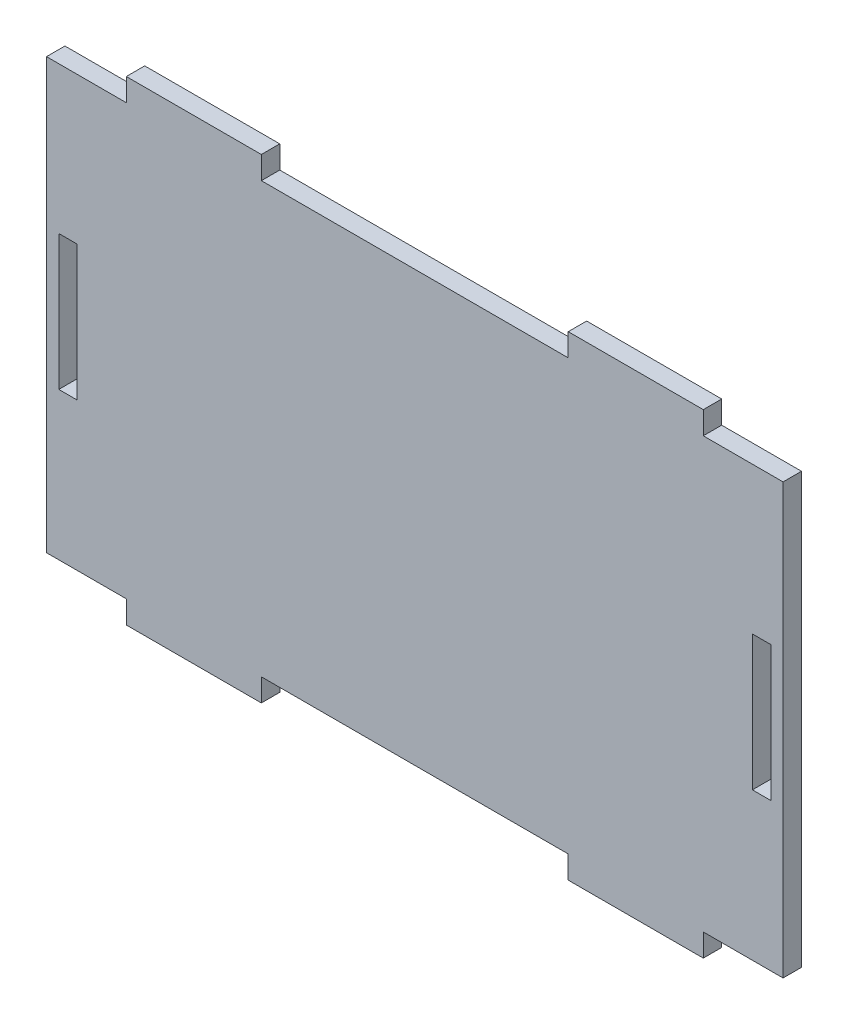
from build123d import *

# Parameters (mm, degrees)
SKETCH1_W           = 3
SKETCH1_H           = 22
BOSS_EXTRUDE1_DEPTH = 3


with BuildPart() as part:
    # Sketch1 → Boss-Extrude1 (new body)
    with BuildSketch(Plane.XY):
        Polygon((107, 70), (120, 70), (120, 0), (107, 0), (107, -3.695987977), (85, -3.695987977), (85, 0), (44.531651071, 0), (35, 0), (35, -3.695987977), (13, -3.695987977), (13, 0), (0, 0), (0, 70), (13, 70), (13, 73.695987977), (35, 73.695987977), (35, 70), (85, 70), (85, 73.695987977), (107, 73.695987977), align=None)
        with Locations((3.5, 35.046146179)):
            Rectangle(SKETCH1_W, SKETCH1_H, mode=Mode.SUBTRACT)
        with Locations((116.5, 35.046146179)):
            Rectangle(SKETCH1_W, SKETCH1_H, mode=Mode.SUBTRACT)
    extrude(amount=BOSS_EXTRUDE1_DEPTH)


solid = part.part
